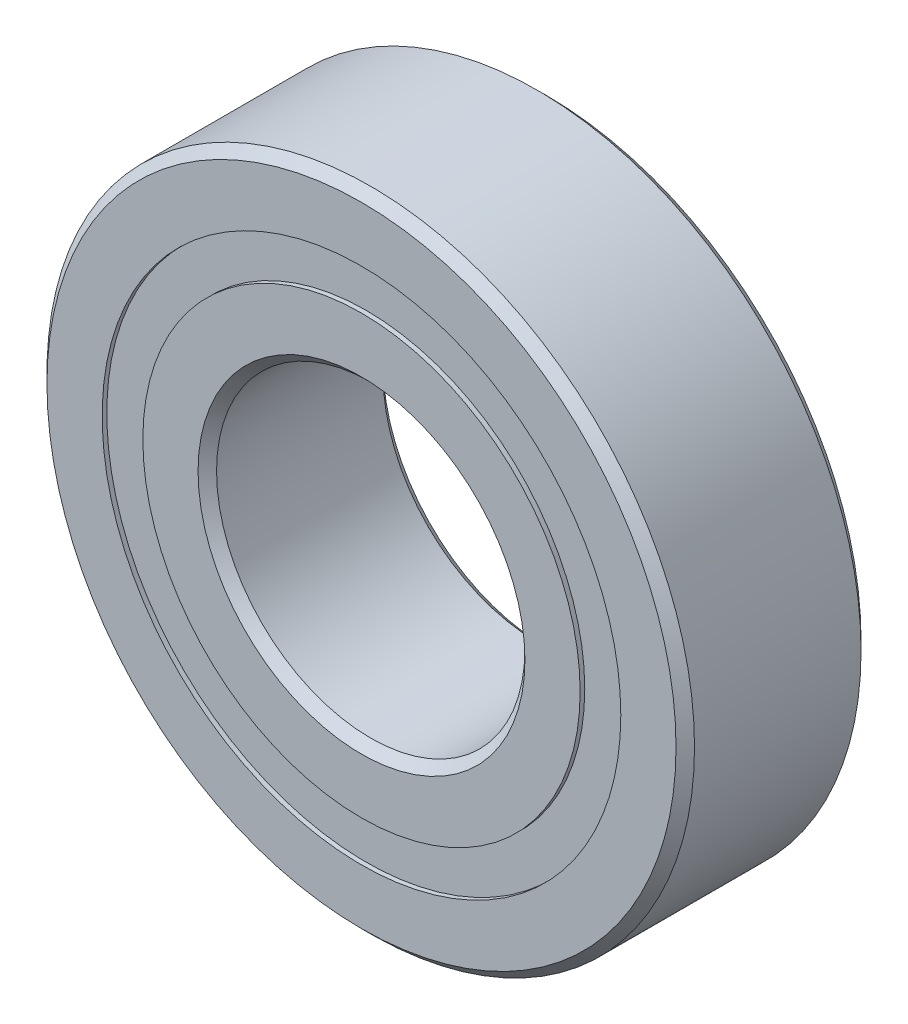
from build123d import *

# Parameters (mm, degrees)
CIRPATTERN1_COUNT = 14
SKETCH6_W         = 2.725099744
SKETCH6_H         = 2.637362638


with BuildPart() as part:
    # Sketch1 → Revolve1 (revolve)
    with BuildSketch(Plane(origin=(0, 0, 0), x_dir=(0, 0, -1), z_dir=(1, 0, 0)), mode=Mode.PRIVATE) as revolve1_sk:
        with BuildLine():
            Line((5.4, 21), (-5.4, 21))
            Line((-5.4, 21), (-6, 20.4))
            Line((-6, 20.4), (-6, 16.818681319))
            Line((-6, 16.818681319), (-2.666666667, 16.818681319))
            ThreePointArc((-2.666666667, 16.818681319), (0, 18.474900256), (2.666666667, 16.818681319))
            Line((2.666666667, 16.818681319), (6, 16.818681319))
            Line((6, 16.818681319), (6, 20.4))
            Line((6, 20.4), (5.4, 21))
        make_face()
    revolve(revolve1_sk.sketch.rotate(Axis((0, 0, 6), (0, 0, -1)), 90), axis=Axis((0, 0, 6), (0, 0, -1)))


with BuildPart() as body_2:
    # Sketch3 → Revolve3 (revolve)
    with BuildSketch(Plane(origin=(0, 0, 0), x_dir=(0, 0, -1), z_dir=(1, 0, 0)), mode=Mode.PRIVATE) as revolve3_sk:
        with BuildLine():
            Line((-6, 14.181318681), (-2.666666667, 14.181318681))
            ThreePointArc((-2.666666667, 14.181318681), (0, 12.525099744), (2.666666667, 14.181318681))
            Line((2.666666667, 14.181318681), (6, 14.181318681))
            Line((6, 14.181318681), (6, 10.6))
            Line((6, 10.6), (5.4, 10))
            Line((5.4, 10), (-5.4, 10))
            Line((-5.4, 10), (-6, 10.6))
            Line((-6, 10.6), (-6, 14.181318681))
        make_face()
    revolve(revolve3_sk.sketch.rotate(Axis((0, 0, 6), (0, 0, -1)), 90), axis=Axis((0, 0, 6), (0, 0, -1)))


with BuildPart() as body_3:
    # Sketch4 → Revolve4 (revolve)
    with BuildSketch(Plane(origin=(0, 0, 0), x_dir=(0, 0, -1), z_dir=(1, 0, 0))):
        with BuildLine():
            Line((-2.974900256, 15.5), (2.974900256, 15.5))
            ThreePointArc((2.974900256, 15.5), (0, 18.474900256), (-2.974900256, 15.5))
        make_face()
    revolve(axis=Axis((0, 15.5, 2.974900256), (0, 0, -1)))


with BuildPart() as cirpattern1_1:
    # CirPattern1: pattern copy
    add(body_3.part.rotate(Axis((0, 0, 0), (0, 0, 1)), 1 * 360 / CIRPATTERN1_COUNT))


with BuildPart() as cirpattern1_2:
    # CirPattern1: pattern copy
    add(body_3.part.rotate(Axis((0, 0, 0), (0, 0, 1)), 2 * 360 / CIRPATTERN1_COUNT))


with BuildPart() as cirpattern1_3:
    # CirPattern1: pattern copy
    add(body_3.part.rotate(Axis((0, 0, 0), (0, 0, 1)), 3 * 360 / CIRPATTERN1_COUNT))


with BuildPart() as cirpattern1_4:
    # CirPattern1: pattern copy
    add(body_3.part.rotate(Axis((0, 0, 0), (0, 0, 1)), 4 * 360 / CIRPATTERN1_COUNT))


with BuildPart() as cirpattern1_5:
    # CirPattern1: pattern copy
    add(body_3.part.rotate(Axis((0, 0, 0), (0, 0, 1)), 5 * 360 / CIRPATTERN1_COUNT))


with BuildPart() as cirpattern1_6:
    # CirPattern1: pattern copy
    add(body_3.part.rotate(Axis((0, 0, 0), (0, 0, 1)), 6 * 360 / CIRPATTERN1_COUNT))


with BuildPart() as cirpattern1_7:
    # CirPattern1: pattern copy
    add(body_3.part.rotate(Axis((0, 0, 0), (0, 0, 1)), 7 * 360 / CIRPATTERN1_COUNT))


with BuildPart() as cirpattern1_8:
    # CirPattern1: pattern copy
    add(body_3.part.rotate(Axis((0, 0, 0), (0, 0, 1)), 8 * 360 / CIRPATTERN1_COUNT))


with BuildPart() as cirpattern1_9:
    # CirPattern1: pattern copy
    add(body_3.part.rotate(Axis((0, 0, 0), (0, 0, 1)), 9 * 360 / CIRPATTERN1_COUNT))


with BuildPart() as cirpattern1_10:
    # CirPattern1: pattern copy
    add(body_3.part.rotate(Axis((0, 0, 0), (0, 0, 1)), 10 * 360 / CIRPATTERN1_COUNT))


with BuildPart() as cirpattern1_11:
    # CirPattern1: pattern copy
    add(body_3.part.rotate(Axis((0, 0, 0), (0, 0, 1)), 11 * 360 / CIRPATTERN1_COUNT))


with BuildPart() as cirpattern1_12:
    # CirPattern1: pattern copy
    add(body_3.part.rotate(Axis((0, 0, 0), (0, 0, 1)), 12 * 360 / CIRPATTERN1_COUNT))


with BuildPart() as cirpattern1_13:
    # CirPattern1: pattern copy
    add(body_3.part.rotate(Axis((0, 0, 0), (0, 0, 1)), 13 * 360 / CIRPATTERN1_COUNT))


with BuildPart() as body_17:
    # Sketch6 → Revolve5 (revolve)
    with BuildSketch(Plane(origin=(0, 0, 0), x_dir=(0, 0, -1), z_dir=(1, 0, 0)), mode=Mode.PRIVATE) as revolve5_sk:
        with Locations((-4.337450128, 15.5)):
            Rectangle(SKETCH6_W, SKETCH6_H)
        with Locations((4.337450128, 15.5)):
            Rectangle(SKETCH6_W, SKETCH6_H)
    revolve(revolve5_sk.sketch.rotate(Axis((0, 0, 6), (0, 0, -1)), 90), axis=Axis((0, 0, 6), (0, 0, -1)))


solid = Compound([part.part, body_2.part, body_3.part, cirpattern1_1.part, cirpattern1_2.part, cirpattern1_3.part, cirpattern1_4.part, cirpattern1_5.part, cirpattern1_6.part, cirpattern1_7.part, cirpattern1_8.part, cirpattern1_9.part, cirpattern1_10.part, cirpattern1_11.part, cirpattern1_12.part, cirpattern1_13.part, body_17.part])
